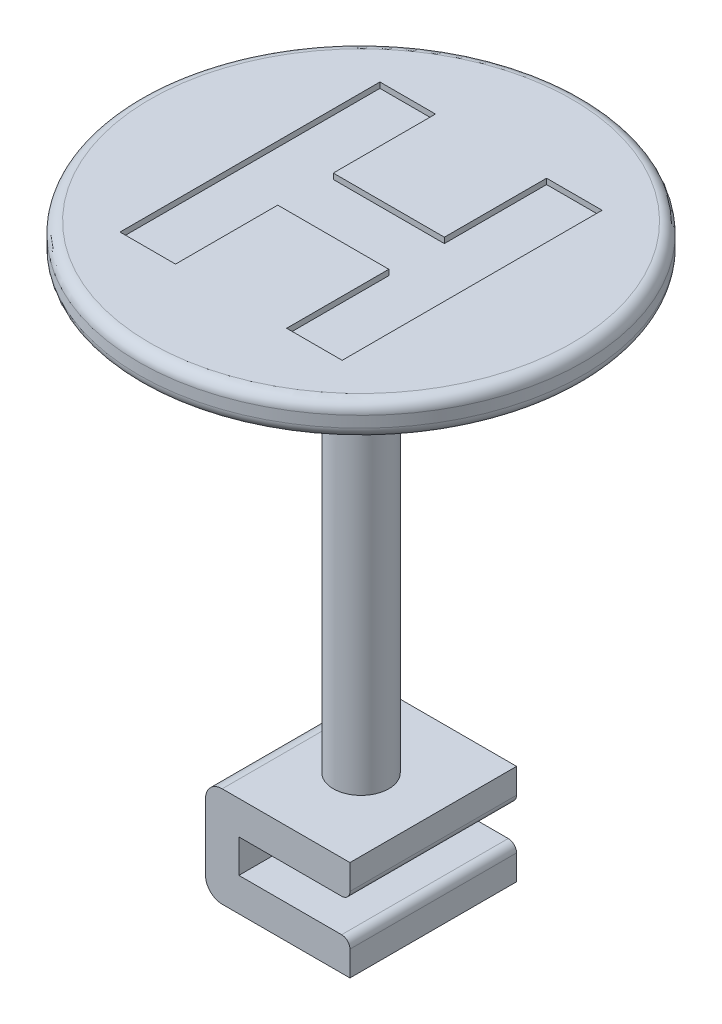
ISO-10303-21;
HEADER;
FILE_DESCRIPTION(('STEP AP214'),'2;1');
FILE_NAME('part.step','',(''),(''),'','','');
FILE_SCHEMA(('AUTOMOTIVE_DESIGN { 1 0 10303 214 1 1 1 1 }'));
ENDSEC;
DATA;
#1=APPLICATION_CONTEXT('core data for automotive mechanical design processes');
#2=APPLICATION_PROTOCOL_DEFINITION('international standard','automotive_design',2000,#1);
#3=PRODUCT_CONTEXT('',#1,'mechanical');
#4=PRODUCT('Part','Part','',(#3));
#5=PRODUCT_RELATED_PRODUCT_CATEGORY('part','',(#4));
#6=PRODUCT_DEFINITION_FORMATION('','',#4);
#7=PRODUCT_DEFINITION_CONTEXT('part definition',#1,'design');
#8=PRODUCT_DEFINITION('design','',#6,#7);
#9=PRODUCT_DEFINITION_SHAPE('','',#8);
#10=(LENGTH_UNIT() NAMED_UNIT(*) SI_UNIT(.MILLI.,.METRE.));
#11=(NAMED_UNIT(*) PLANE_ANGLE_UNIT() SI_UNIT($,.RADIAN.));
#12=(NAMED_UNIT(*) SI_UNIT($,.STERADIAN.) SOLID_ANGLE_UNIT());
#13=UNCERTAINTY_MEASURE_WITH_UNIT(LENGTH_MEASURE(1.E-05),#10,'distance_accuracy_value','');
#14=(GEOMETRIC_REPRESENTATION_CONTEXT(3) GLOBAL_UNCERTAINTY_ASSIGNED_CONTEXT((#13)) GLOBAL_UNIT_ASSIGNED_CONTEXT((#10,
#11,#12)) REPRESENTATION_CONTEXT('',''));
#15=CARTESIAN_POINT('',(0.,0.,0.));
#16=DIRECTION('',(0.,0.,1.));
#17=DIRECTION('',(1.,0.,0.));
#18=AXIS2_PLACEMENT_3D('',#15,#16,#17);
#19=CARTESIAN_POINT('',(-3.,6.,15.));
#20=DIRECTION('',(0.,-1.,0.));
#21=DIRECTION('',(0.,0.,-1.));
#22=AXIS2_PLACEMENT_3D('',#19,#20,#21);
#23=PLANE('',#22);
#24=DIRECTION('',(-1.,0.,0.));
#25=VECTOR('',#24,1.);
#26=CARTESIAN_POINT('',(-3.,6.,0.));
#27=LINE('',#26,#25);
#28=CARTESIAN_POINT('',(10.,6.,0.));
#29=VERTEX_POINT('',#28);
#30=CARTESIAN_POINT('',(-1.5,6.,0.));
#31=VERTEX_POINT('',#30);
#32=EDGE_CURVE('E317',#29,#31,#27,.T.);
#33=ORIENTED_EDGE('',*,*,#32,.T.);
#34=DIRECTION('',(0.,0.,-1.));
#35=VECTOR('',#34,1.);
#36=CARTESIAN_POINT('',(-1.5,6.,15.));
#37=LINE('',#36,#35);
#38=CARTESIAN_POINT('',(-1.5,6.,15.));
#39=VERTEX_POINT('',#38);
#40=EDGE_CURVE('E49',#31,#39,#37,.F.);
#41=ORIENTED_EDGE('',*,*,#40,.T.);
#42=DIRECTION('',(-1.,0.,0.));
#43=VECTOR('',#42,1.);
#44=CARTESIAN_POINT('',(-3.,6.,15.));
#45=LINE('',#44,#43);
#46=CARTESIAN_POINT('',(10.,6.,15.));
#47=VERTEX_POINT('',#46);
#48=EDGE_CURVE('E336',#47,#39,#45,.T.);
#49=ORIENTED_EDGE('',*,*,#48,.F.);
#50=DIRECTION('',(0.,0.,-1.));
#51=VECTOR('',#50,1.);
#52=CARTESIAN_POINT('',(10.,6.,15.));
#53=LINE('',#52,#51);
#54=EDGE_CURVE('E353',#47,#29,#53,.T.);
#55=ORIENTED_EDGE('',*,*,#54,.T.);
#56=EDGE_LOOP('',(#33,#41,#49,#55));
#57=FACE_BOUND('',#56,.T.);
#58=CARTESIAN_POINT('',(3.5,6.,7.5));
#59=DIRECTION('',(0.,-1.,0.));
#60=DIRECTION('',(0.,0.,-1.));
#61=AXIS2_PLACEMENT_3D('',#58,#59,#60);
#62=CIRCLE('',#61,2.5);
#63=CARTESIAN_POINT('',(3.5,6.,5.));
#64=VERTEX_POINT('',#63);
#65=EDGE_CURVE('E377',#64,#64,#62,.F.);
#66=ORIENTED_EDGE('',*,*,#65,.F.);
#67=EDGE_LOOP('',(#66));
#68=FACE_BOUND('',#67,.T.);
#69=ADVANCED_FACE('F34',(#57,#68),#23,.F.);
#70=CARTESIAN_POINT('',(0.,0.,15.));
#71=DIRECTION('',(-1.,0.,0.));
#72=DIRECTION('',(0.,0.,1.));
#73=AXIS2_PLACEMENT_3D('',#70,#71,#72);
#74=PLANE('',#73);
#75=DIRECTION('',(0.,1.,0.));
#76=VECTOR('',#75,1.);
#77=CARTESIAN_POINT('',(0.,0.,0.));
#78=LINE('',#77,#76);
#79=CARTESIAN_POINT('',(0.,0.,0.));
#80=VERTEX_POINT('',#79);
#81=CARTESIAN_POINT('',(0.,3.,0.));
#82=VERTEX_POINT('',#81);
#83=EDGE_CURVE('E309',#80,#82,#78,.T.);
#84=ORIENTED_EDGE('',*,*,#83,.T.);
#85=DIRECTION('',(0.,0.,-1.));
#86=VECTOR('',#85,1.);
#87=CARTESIAN_POINT('',(0.,3.,15.));
#88=LINE('',#87,#86);
#89=CARTESIAN_POINT('',(0.,3.,15.));
#90=VERTEX_POINT('',#89);
#91=EDGE_CURVE('E356',#90,#82,#88,.T.);
#92=ORIENTED_EDGE('',*,*,#91,.F.);
#93=DIRECTION('',(0.,1.,0.));
#94=VECTOR('',#93,1.);
#95=CARTESIAN_POINT('',(0.,0.,15.));
#96=LINE('',#95,#94);
#97=CARTESIAN_POINT('',(0.,0.,15.));
#98=VERTEX_POINT('',#97);
#99=EDGE_CURVE('E328',#98,#90,#96,.T.);
#100=ORIENTED_EDGE('',*,*,#99,.F.);
#101=DIRECTION('',(0.,0.,-1.));
#102=VECTOR('',#101,1.);
#103=CARTESIAN_POINT('',(0.,0.,15.));
#104=LINE('',#103,#102);
#105=EDGE_CURVE('E347',#98,#80,#104,.T.);
#106=ORIENTED_EDGE('',*,*,#105,.T.);
#107=EDGE_LOOP('',(#84,#92,#100,#106));
#108=FACE_BOUND('',#107,.T.);
#109=ADVANCED_FACE('F36',(#108),#74,.F.);
#110=CARTESIAN_POINT('',(0.,3.,15.));
#111=DIRECTION('',(0.,1.,0.));
#112=DIRECTION('',(0.,0.,1.));
#113=AXIS2_PLACEMENT_3D('',#110,#111,#112);
#114=PLANE('',#113);
#115=DIRECTION('',(1.,0.,0.));
#116=VECTOR('',#115,1.);
#117=CARTESIAN_POINT('',(0.,3.,0.));
#118=LINE('',#117,#116);
#119=CARTESIAN_POINT('',(9.25,3.,0.));
#120=VERTEX_POINT('',#119);
#121=EDGE_CURVE('E312',#82,#120,#118,.T.);
#122=ORIENTED_EDGE('',*,*,#121,.T.);
#123=DIRECTION('',(0.,0.,-1.));
#124=VECTOR('',#123,1.);
#125=CARTESIAN_POINT('',(9.25,3.,15.));
#126=LINE('',#125,#124);
#127=CARTESIAN_POINT('',(9.25,3.,15.));
#128=VERTEX_POINT('',#127);
#129=EDGE_CURVE('E375',#120,#128,#126,.F.);
#130=ORIENTED_EDGE('',*,*,#129,.T.);
#131=DIRECTION('',(1.,0.,0.));
#132=VECTOR('',#131,1.);
#133=CARTESIAN_POINT('',(0.,3.,15.));
#134=LINE('',#133,#132);
#135=EDGE_CURVE('E331',#90,#128,#134,.T.);
#136=ORIENTED_EDGE('',*,*,#135,.F.);
#137=ORIENTED_EDGE('',*,*,#91,.T.);
#138=EDGE_LOOP('',(#122,#130,#136,#137));
#139=FACE_BOUND('',#138,.T.);
#140=ADVANCED_FACE('F441',(#139),#114,.F.);
#141=CARTESIAN_POINT('',(10.,3.,15.));
#142=DIRECTION('',(-1.,0.,0.));
#143=DIRECTION('',(0.,0.,1.));
#144=AXIS2_PLACEMENT_3D('',#141,#142,#143);
#145=PLANE('',#144);
#146=DIRECTION('',(0.,1.,0.));
#147=VECTOR('',#146,1.);
#148=CARTESIAN_POINT('',(10.,3.,15.));
#149=LINE('',#148,#147);
#150=CARTESIAN_POINT('',(10.,3.75,15.));
#151=VERTEX_POINT('',#150);
#152=EDGE_CURVE('E334',#151,#47,#149,.T.);
#153=ORIENTED_EDGE('',*,*,#152,.F.);
#154=DIRECTION('',(0.,0.,-1.));
#155=VECTOR('',#154,1.);
#156=CARTESIAN_POINT('',(10.,3.75,15.));
#157=LINE('',#156,#155);
#158=CARTESIAN_POINT('',(10.,3.75,0.));
#159=VERTEX_POINT('',#158);
#160=EDGE_CURVE('E372',#151,#159,#157,.T.);
#161=ORIENTED_EDGE('',*,*,#160,.T.);
#162=DIRECTION('',(0.,1.,0.));
#163=VECTOR('',#162,1.);
#164=CARTESIAN_POINT('',(10.,3.,0.));
#165=LINE('',#164,#163);
#166=EDGE_CURVE('E315',#159,#29,#165,.T.);
#167=ORIENTED_EDGE('',*,*,#166,.T.);
#168=ORIENTED_EDGE('',*,*,#54,.F.);
#169=EDGE_LOOP('',(#153,#161,#167,#168));
#170=FACE_BOUND('',#169,.T.);
#171=ADVANCED_FACE('F448',(#170),#145,.F.);
#172=CARTESIAN_POINT('',(-3.,-3.,15.));
#173=DIRECTION('',(1.,0.,0.));
#174=DIRECTION('',(0.,1.,0.));
#175=AXIS2_PLACEMENT_3D('',#172,#173,#174);
#176=PLANE('',#175);
#177=DIRECTION('',(0.,-1.,0.));
#178=VECTOR('',#177,1.);
#179=CARTESIAN_POINT('',(-3.,-3.,0.));
#180=LINE('',#179,#178);
#181=CARTESIAN_POINT('',(-3.,4.5,0.));
#182=VERTEX_POINT('',#181);
#183=CARTESIAN_POINT('',(-3.,-1.5,0.));
#184=VERTEX_POINT('',#183);
#185=EDGE_CURVE('E319',#182,#184,#180,.T.);
#186=ORIENTED_EDGE('',*,*,#185,.T.);
#187=DIRECTION('',(0.,0.,-1.));
#188=VECTOR('',#187,1.);
#189=CARTESIAN_POINT('',(-3.,-1.5,15.));
#190=LINE('',#189,#188);
#191=CARTESIAN_POINT('',(-3.,-1.5,15.));
#192=VERTEX_POINT('',#191);
#193=EDGE_CURVE('E57',#184,#192,#190,.F.);
#194=ORIENTED_EDGE('',*,*,#193,.T.);
#195=DIRECTION('',(0.,-1.,0.));
#196=VECTOR('',#195,1.);
#197=CARTESIAN_POINT('',(-3.,-3.,15.));
#198=LINE('',#197,#196);
#199=CARTESIAN_POINT('',(-3.,4.5,15.));
#200=VERTEX_POINT('',#199);
#201=EDGE_CURVE('E338',#200,#192,#198,.T.);
#202=ORIENTED_EDGE('',*,*,#201,.F.);
#203=DIRECTION('',(0.,0.,-1.));
#204=VECTOR('',#203,1.);
#205=CARTESIAN_POINT('',(-3.,4.5,15.));
#206=LINE('',#205,#204);
#207=EDGE_CURVE('E387',#200,#182,#206,.T.);
#208=ORIENTED_EDGE('',*,*,#207,.T.);
#209=EDGE_LOOP('',(#186,#194,#202,#208));
#210=FACE_BOUND('',#209,.T.);
#211=ADVANCED_FACE('F446',(#210),#176,.F.);
#212=CARTESIAN_POINT('',(-3.,-3.,15.));
#213=DIRECTION('',(0.,1.,0.));
#214=DIRECTION('',(0.,0.,1.));
#215=AXIS2_PLACEMENT_3D('',#212,#213,#214);
#216=PLANE('',#215);
#217=DIRECTION('',(1.,0.,0.));
#218=VECTOR('',#217,1.);
#219=CARTESIAN_POINT('',(-3.,-3.,15.));
#220=LINE('',#219,#218);
#221=CARTESIAN_POINT('',(-1.5,-3.,15.));
#222=VERTEX_POINT('',#221);
#223=CARTESIAN_POINT('',(10.,-3.,15.));
#224=VERTEX_POINT('',#223);
#225=EDGE_CURVE('E340',#222,#224,#220,.T.);
#226=ORIENTED_EDGE('',*,*,#225,.F.);
#227=DIRECTION('',(0.,0.,-1.));
#228=VECTOR('',#227,1.);
#229=CARTESIAN_POINT('',(-1.5,-3.,15.));
#230=LINE('',#229,#228);
#231=CARTESIAN_POINT('',(-1.5,-3.,0.));
#232=VERTEX_POINT('',#231);
#233=EDGE_CURVE('E380',#222,#232,#230,.T.);
#234=ORIENTED_EDGE('',*,*,#233,.T.);
#235=DIRECTION('',(1.,0.,0.));
#236=VECTOR('',#235,1.);
#237=CARTESIAN_POINT('',(-3.,-3.,0.));
#238=LINE('',#237,#236);
#239=CARTESIAN_POINT('',(10.,-3.,0.));
#240=VERTEX_POINT('',#239);
#241=EDGE_CURVE('E321',#232,#240,#238,.T.);
#242=ORIENTED_EDGE('',*,*,#241,.T.);
#243=DIRECTION('',(0.,0.,-1.));
#244=VECTOR('',#243,1.);
#245=CARTESIAN_POINT('',(10.,-3.,15.));
#246=LINE('',#245,#244);
#247=EDGE_CURVE('E350',#224,#240,#246,.T.);
#248=ORIENTED_EDGE('',*,*,#247,.F.);
#249=EDGE_LOOP('',(#226,#234,#242,#248));
#250=FACE_BOUND('',#249,.T.);
#251=ADVANCED_FACE('F482',(#250),#216,.F.);
#252=CARTESIAN_POINT('',(10.,0.,15.));
#253=DIRECTION('',(-1.,0.,0.));
#254=DIRECTION('',(0.,0.,1.));
#255=AXIS2_PLACEMENT_3D('',#252,#253,#254);
#256=PLANE('',#255);
#257=DIRECTION('',(0.,1.,0.));
#258=VECTOR('',#257,1.);
#259=CARTESIAN_POINT('',(10.,0.,0.));
#260=LINE('',#259,#258);
#261=CARTESIAN_POINT('',(10.,-0.75,0.));
#262=VERTEX_POINT('',#261);
#263=EDGE_CURVE('E323',#240,#262,#260,.T.);
#264=ORIENTED_EDGE('',*,*,#263,.T.);
#265=DIRECTION('',(0.,0.,-1.));
#266=VECTOR('',#265,1.);
#267=CARTESIAN_POINT('',(10.,-0.75,15.));
#268=LINE('',#267,#266);
#269=CARTESIAN_POINT('',(10.,-0.75,15.));
#270=VERTEX_POINT('',#269);
#271=EDGE_CURVE('E366',#262,#270,#268,.F.);
#272=ORIENTED_EDGE('',*,*,#271,.T.);
#273=DIRECTION('',(0.,1.,0.));
#274=VECTOR('',#273,1.);
#275=CARTESIAN_POINT('',(10.,0.,15.));
#276=LINE('',#275,#274);
#277=EDGE_CURVE('E342',#224,#270,#276,.T.);
#278=ORIENTED_EDGE('',*,*,#277,.F.);
#279=ORIENTED_EDGE('',*,*,#247,.T.);
#280=EDGE_LOOP('',(#264,#272,#278,#279));
#281=FACE_BOUND('',#280,.T.);
#282=ADVANCED_FACE('F497',(#281),#256,.F.);
#283=CARTESIAN_POINT('',(0.,0.,15.));
#284=DIRECTION('',(0.,-1.,0.));
#285=DIRECTION('',(0.,0.,-1.));
#286=AXIS2_PLACEMENT_3D('',#283,#284,#285);
#287=PLANE('',#286);
#288=DIRECTION('',(-1.,0.,0.));
#289=VECTOR('',#288,1.);
#290=CARTESIAN_POINT('',(0.,0.,15.));
#291=LINE('',#290,#289);
#292=CARTESIAN_POINT('',(9.25,0.,15.));
#293=VERTEX_POINT('',#292);
#294=EDGE_CURVE('E345',#293,#98,#291,.T.);
#295=ORIENTED_EDGE('',*,*,#294,.F.);
#296=DIRECTION('',(0.,0.,-1.));
#297=VECTOR('',#296,1.);
#298=CARTESIAN_POINT('',(9.25,0.,15.));
#299=LINE('',#298,#297);
#300=CARTESIAN_POINT('',(9.25,0.,0.));
#301=VERTEX_POINT('',#300);
#302=EDGE_CURVE('E359',#293,#301,#299,.T.);
#303=ORIENTED_EDGE('',*,*,#302,.T.);
#304=DIRECTION('',(-1.,0.,0.));
#305=VECTOR('',#304,1.);
#306=CARTESIAN_POINT('',(0.,0.,0.));
#307=LINE('',#306,#305);
#308=EDGE_CURVE('E326',#301,#80,#307,.T.);
#309=ORIENTED_EDGE('',*,*,#308,.T.);
#310=ORIENTED_EDGE('',*,*,#105,.F.);
#311=EDGE_LOOP('',(#295,#303,#309,#310));
#312=FACE_BOUND('',#311,.T.);
#313=ADVANCED_FACE('F494',(#312),#287,.F.);
#314=CARTESIAN_POINT('',(0.,3.,15.));
#315=DIRECTION('',(0.,0.,-1.));
#316=DIRECTION('',(-1.,0.,0.));
#317=AXIS2_PLACEMENT_3D('',#314,#315,#316);
#318=PLANE('',#317);
#319=ORIENTED_EDGE('',*,*,#201,.T.);
#320=CARTESIAN_POINT('',(-1.5,-1.5,15.));
#321=DIRECTION('',(0.,0.,-1.));
#322=DIRECTION('',(-1.,0.,0.));
#323=AXIS2_PLACEMENT_3D('',#320,#321,#322);
#324=CIRCLE('',#323,1.5);
#325=EDGE_CURVE('E393',#192,#222,#324,.F.);
#326=ORIENTED_EDGE('',*,*,#325,.T.);
#327=ORIENTED_EDGE('',*,*,#225,.T.);
#328=ORIENTED_EDGE('',*,*,#277,.T.);
#329=CARTESIAN_POINT('',(9.25,-0.75,15.));
#330=DIRECTION('',(0.,0.,-1.));
#331=DIRECTION('',(-1.,0.,0.));
#332=AXIS2_PLACEMENT_3D('',#329,#330,#331);
#333=CIRCLE('',#332,0.75);
#334=EDGE_CURVE('E370',#270,#293,#333,.F.);
#335=ORIENTED_EDGE('',*,*,#334,.T.);
#336=ORIENTED_EDGE('',*,*,#294,.T.);
#337=ORIENTED_EDGE('',*,*,#99,.T.);
#338=ORIENTED_EDGE('',*,*,#135,.T.);
#339=CARTESIAN_POINT('',(9.25,3.75,15.));
#340=DIRECTION('',(0.,0.,-1.));
#341=DIRECTION('',(-1.,0.,0.));
#342=AXIS2_PLACEMENT_3D('',#339,#340,#341);
#343=CIRCLE('',#342,0.75);
#344=EDGE_CURVE('E368',#128,#151,#343,.F.);
#345=ORIENTED_EDGE('',*,*,#344,.T.);
#346=ORIENTED_EDGE('',*,*,#152,.T.);
#347=ORIENTED_EDGE('',*,*,#48,.T.);
#348=CARTESIAN_POINT('',(-1.5,4.5,15.));
#349=DIRECTION('',(0.,0.,-1.));
#350=DIRECTION('',(-1.,0.,0.));
#351=AXIS2_PLACEMENT_3D('',#348,#349,#350);
#352=CIRCLE('',#351,1.5);
#353=EDGE_CURVE('E391',#39,#200,#352,.F.);
#354=ORIENTED_EDGE('',*,*,#353,.T.);
#355=EDGE_LOOP('',(#319,#326,#327,#328,#335,#336,#337,#338,#345,#346,#347,#354));
#356=FACE_BOUND('',#355,.T.);
#357=ADVANCED_FACE('F465',(#356),#318,.F.);
#358=CARTESIAN_POINT('',(0.,3.,0.));
#359=DIRECTION('',(0.,0.,-1.));
#360=DIRECTION('',(-1.,0.,0.));
#361=AXIS2_PLACEMENT_3D('',#358,#359,#360);
#362=PLANE('',#361);
#363=ORIENTED_EDGE('',*,*,#241,.F.);
#364=CARTESIAN_POINT('',(-1.5,-1.5,0.));
#365=DIRECTION('',(0.,0.,-1.));
#366=DIRECTION('',(-1.,0.,0.));
#367=AXIS2_PLACEMENT_3D('',#364,#365,#366);
#368=CIRCLE('',#367,1.5);
#369=EDGE_CURVE('E385',#232,#184,#368,.T.);
#370=ORIENTED_EDGE('',*,*,#369,.T.);
#371=ORIENTED_EDGE('',*,*,#185,.F.);
#372=CARTESIAN_POINT('',(-1.5,4.5,0.));
#373=DIRECTION('',(0.,0.,-1.));
#374=DIRECTION('',(-1.,0.,0.));
#375=AXIS2_PLACEMENT_3D('',#372,#373,#374);
#376=CIRCLE('',#375,1.5);
#377=EDGE_CURVE('E383',#182,#31,#376,.T.);
#378=ORIENTED_EDGE('',*,*,#377,.T.);
#379=ORIENTED_EDGE('',*,*,#32,.F.);
#380=ORIENTED_EDGE('',*,*,#166,.F.);
#381=CARTESIAN_POINT('',(9.25,3.75,0.));
#382=DIRECTION('',(0.,0.,-1.));
#383=DIRECTION('',(-1.,0.,0.));
#384=AXIS2_PLACEMENT_3D('',#381,#382,#383);
#385=CIRCLE('',#384,0.75);
#386=EDGE_CURVE('E362',#159,#120,#385,.T.);
#387=ORIENTED_EDGE('',*,*,#386,.T.);
#388=ORIENTED_EDGE('',*,*,#121,.F.);
#389=ORIENTED_EDGE('',*,*,#83,.F.);
#390=ORIENTED_EDGE('',*,*,#308,.F.);
#391=CARTESIAN_POINT('',(9.25,-0.75,0.));
#392=DIRECTION('',(0.,0.,-1.));
#393=DIRECTION('',(-1.,0.,0.));
#394=AXIS2_PLACEMENT_3D('',#391,#392,#393);
#395=CIRCLE('',#394,0.75);
#396=EDGE_CURVE('E364',#301,#262,#395,.T.);
#397=ORIENTED_EDGE('',*,*,#396,.T.);
#398=ORIENTED_EDGE('',*,*,#263,.F.);
#399=EDGE_LOOP('',(#363,#370,#371,#378,#379,#380,#387,#388,#389,#390,#397,#398));
#400=FACE_BOUND('',#399,.T.);
#401=ADVANCED_FACE('F474',(#400),#362,.T.);
#402=CARTESIAN_POINT('',(9.25,-0.75,15.));
#403=DIRECTION('',(0.,0.,-1.));
#404=DIRECTION('',(-1.,0.,0.));
#405=AXIS2_PLACEMENT_3D('',#402,#403,#404);
#406=CYLINDRICAL_SURFACE('',#405,0.75);
#407=ORIENTED_EDGE('',*,*,#334,.F.);
#408=ORIENTED_EDGE('',*,*,#271,.F.);
#409=ORIENTED_EDGE('',*,*,#396,.F.);
#410=ORIENTED_EDGE('',*,*,#302,.F.);
#411=EDGE_LOOP('',(#407,#408,#409,#410));
#412=FACE_BOUND('',#411,.T.);
#413=ADVANCED_FACE('F491',(#412),#406,.T.);
#414=CARTESIAN_POINT('',(9.25,3.75,15.));
#415=DIRECTION('',(0.,0.,-1.));
#416=DIRECTION('',(-1.,0.,0.));
#417=AXIS2_PLACEMENT_3D('',#414,#415,#416);
#418=CYLINDRICAL_SURFACE('',#417,0.75);
#419=ORIENTED_EDGE('',*,*,#344,.F.);
#420=ORIENTED_EDGE('',*,*,#129,.F.);
#421=ORIENTED_EDGE('',*,*,#386,.F.);
#422=ORIENTED_EDGE('',*,*,#160,.F.);
#423=EDGE_LOOP('',(#419,#420,#421,#422));
#424=FACE_BOUND('',#423,.T.);
#425=ADVANCED_FACE('F461',(#424),#418,.T.);
#426=CARTESIAN_POINT('',(3.5,46.,7.5));
#427=DIRECTION('',(0.,-1.,0.));
#428=DIRECTION('',(0.,0.,-1.));
#429=AXIS2_PLACEMENT_3D('',#426,#427,#428);
#430=CYLINDRICAL_SURFACE('',#429,2.5);
#431=CARTESIAN_POINT('',(3.5,46.,7.5));
#432=DIRECTION('',(0.,1.,0.));
#433=DIRECTION('',(0.,0.,1.));
#434=AXIS2_PLACEMENT_3D('',#431,#432,#433);
#435=CIRCLE('',#434,2.5);
#436=CARTESIAN_POINT('',(3.5,46.,10.));
#437=VERTEX_POINT('',#436);
#438=EDGE_CURVE('E288',#437,#437,#435,.T.);
#439=ORIENTED_EDGE('',*,*,#438,.F.);
#440=EDGE_LOOP('',(#439));
#441=FACE_BOUND('',#440,.T.);
#442=ORIENTED_EDGE('',*,*,#65,.T.);
#443=EDGE_LOOP('',(#442));
#444=FACE_BOUND('',#443,.T.);
#445=ADVANCED_FACE('F514',(#441,#444),#430,.T.);
#446=CARTESIAN_POINT('',(3.5,46.,7.5));
#447=DIRECTION('',(0.,1.,0.));
#448=DIRECTION('',(0.,0.,1.));
#449=AXIS2_PLACEMENT_3D('',#446,#447,#448);
#450=PLANE('',#449);
#451=CARTESIAN_POINT('',(3.5,46.,7.5));
#452=DIRECTION('',(0.,1.,0.));
#453=DIRECTION('',(0.,0.,1.));
#454=AXIS2_PLACEMENT_3D('',#451,#452,#453);
#455=CIRCLE('',#454,19.);
#456=CARTESIAN_POINT('',(3.5,46.,26.5));
#457=VERTEX_POINT('',#456);
#458=EDGE_CURVE('E42',#457,#457,#455,.F.);
#459=ORIENTED_EDGE('',*,*,#458,.T.);
#460=EDGE_LOOP('',(#459));
#461=FACE_BOUND('',#460,.T.);
#462=ORIENTED_EDGE('',*,*,#438,.T.);
#463=EDGE_LOOP('',(#462));
#464=FACE_BOUND('',#463,.T.);
#465=ADVANCED_FACE('F404',(#461,#464),#450,.F.);
#466=CARTESIAN_POINT('',(3.5,49.,7.5));
#467=DIRECTION('',(0.,-1.,0.));
#468=DIRECTION('',(0.,0.,-1.));
#469=AXIS2_PLACEMENT_3D('',#466,#467,#468);
#470=CYLINDRICAL_SURFACE('',#469,20.);
#471=CARTESIAN_POINT('',(3.5,47.,7.5));
#472=DIRECTION('',(0.,1.,0.));
#473=DIRECTION('',(0.,0.,1.));
#474=AXIS2_PLACEMENT_3D('',#471,#472,#473);
#475=CIRCLE('',#474,20.);
#476=CARTESIAN_POINT('',(3.5,47.,27.5));
#477=VERTEX_POINT('',#476);
#478=EDGE_CURVE('E399',#477,#477,#475,.T.);
#479=ORIENTED_EDGE('',*,*,#478,.T.);
#480=EDGE_LOOP('',(#479));
#481=FACE_BOUND('',#480,.T.);
#482=CARTESIAN_POINT('',(3.5,48.,7.5));
#483=DIRECTION('',(0.,1.,0.));
#484=DIRECTION('',(0.,0.,1.));
#485=AXIS2_PLACEMENT_3D('',#482,#483,#484);
#486=CIRCLE('',#485,20.);
#487=CARTESIAN_POINT('',(3.5,48.,27.5));
#488=VERTEX_POINT('',#487);
#489=EDGE_CURVE('E396',#488,#488,#486,.F.);
#490=ORIENTED_EDGE('',*,*,#489,.T.);
#491=EDGE_LOOP('',(#490));
#492=FACE_BOUND('',#491,.T.);
#493=ADVANCED_FACE('F415',(#481,#492),#470,.T.);
#494=CARTESIAN_POINT('',(3.5,49.,7.5));
#495=DIRECTION('',(0.,1.,0.));
#496=DIRECTION('',(0.,0.,1.));
#497=AXIS2_PLACEMENT_3D('',#494,#495,#496);
#498=PLANE('',#497);
#499=CARTESIAN_POINT('',(3.5,49.,7.5));
#500=DIRECTION('',(0.,1.,0.));
#501=DIRECTION('',(0.,0.,1.));
#502=AXIS2_PLACEMENT_3D('',#499,#500,#501);
#503=CIRCLE('',#502,19.);
#504=CARTESIAN_POINT('',(3.5,49.,26.5));
#505=VERTEX_POINT('',#504);
#506=EDGE_CURVE('E11',#505,#505,#503,.T.);
#507=ORIENTED_EDGE('',*,*,#506,.T.);
#508=EDGE_LOOP('',(#507));
#509=FACE_BOUND('',#508,.T.);
#510=DIRECTION('',(0.,0.,1.));
#511=VECTOR('',#510,1.);
#512=CARTESIAN_POINT('',(8.5,49.,-4.19890178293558));
#513=LINE('',#512,#511);
#514=CARTESIAN_POINT('',(8.5,49.,-4.19890178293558));
#515=VERTEX_POINT('',#514);
#516=CARTESIAN_POINT('',(8.5,49.,5.));
#517=VERTEX_POINT('',#516);
#518=EDGE_CURVE('E219',#515,#517,#513,.T.);
#519=ORIENTED_EDGE('',*,*,#518,.F.);
#520=DIRECTION('',(-1.,0.,0.));
#521=VECTOR('',#520,1.);
#522=CARTESIAN_POINT('',(8.5,49.,-4.19890178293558));
#523=LINE('',#522,#521);
#524=CARTESIAN_POINT('',(13.5,49.,-4.19890178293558));
#525=VERTEX_POINT('',#524);
#526=EDGE_CURVE('E250',#525,#515,#523,.T.);
#527=ORIENTED_EDGE('',*,*,#526,.F.);
#528=DIRECTION('',(0.,0.,-1.));
#529=VECTOR('',#528,1.);
#530=CARTESIAN_POINT('',(13.5,49.,-4.19890178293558));
#531=LINE('',#530,#529);
#532=CARTESIAN_POINT('',(13.5,49.,19.1989017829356));
#533=VERTEX_POINT('',#532);
#534=EDGE_CURVE('E247',#533,#525,#531,.T.);
#535=ORIENTED_EDGE('',*,*,#534,.F.);
#536=DIRECTION('',(1.,0.,0.));
#537=VECTOR('',#536,1.);
#538=CARTESIAN_POINT('',(8.5,49.,19.1989017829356));
#539=LINE('',#538,#537);
#540=CARTESIAN_POINT('',(8.5,49.,19.1989017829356));
#541=VERTEX_POINT('',#540);
#542=EDGE_CURVE('E244',#541,#533,#539,.T.);
#543=ORIENTED_EDGE('',*,*,#542,.F.);
#544=DIRECTION('',(0.,0.,1.));
#545=VECTOR('',#544,1.);
#546=CARTESIAN_POINT('',(8.5,49.,19.1989017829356));
#547=LINE('',#546,#545);
#548=CARTESIAN_POINT('',(8.5,49.,10.));
#549=VERTEX_POINT('',#548);
#550=EDGE_CURVE('E241',#549,#541,#547,.T.);
#551=ORIENTED_EDGE('',*,*,#550,.F.);
#552=DIRECTION('',(1.,0.,0.));
#553=VECTOR('',#552,1.);
#554=CARTESIAN_POINT('',(8.5,49.,10.));
#555=LINE('',#554,#553);
#556=CARTESIAN_POINT('',(-1.5,49.,10.));
#557=VERTEX_POINT('',#556);
#558=EDGE_CURVE('E238',#557,#549,#555,.T.);
#559=ORIENTED_EDGE('',*,*,#558,.F.);
#560=DIRECTION('',(0.,0.,-1.));
#561=VECTOR('',#560,1.);
#562=CARTESIAN_POINT('',(-1.5,49.,19.1989017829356));
#563=LINE('',#562,#561);
#564=CARTESIAN_POINT('',(-1.5,49.,19.1989017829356));
#565=VERTEX_POINT('',#564);
#566=EDGE_CURVE('E235',#565,#557,#563,.T.);
#567=ORIENTED_EDGE('',*,*,#566,.F.);
#568=DIRECTION('',(1.,0.,0.));
#569=VECTOR('',#568,1.);
#570=CARTESIAN_POINT('',(-1.5,49.,19.1989017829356));
#571=LINE('',#570,#569);
#572=CARTESIAN_POINT('',(-6.5,49.,19.1989017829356));
#573=VERTEX_POINT('',#572);
#574=EDGE_CURVE('E232',#573,#565,#571,.T.);
#575=ORIENTED_EDGE('',*,*,#574,.F.);
#576=DIRECTION('',(0.,0.,1.));
#577=VECTOR('',#576,1.);
#578=CARTESIAN_POINT('',(-6.5,49.,19.1989017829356));
#579=LINE('',#578,#577);
#580=CARTESIAN_POINT('',(-6.5,49.,-4.19890178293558));
#581=VERTEX_POINT('',#580);
#582=EDGE_CURVE('E226',#581,#573,#579,.T.);
#583=ORIENTED_EDGE('',*,*,#582,.F.);
#584=DIRECTION('',(-1.,0.,0.));
#585=VECTOR('',#584,1.);
#586=CARTESIAN_POINT('',(-1.5,49.,-4.19890178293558));
#587=LINE('',#586,#585);
#588=CARTESIAN_POINT('',(-1.5,49.,-4.19890178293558));
#589=VERTEX_POINT('',#588);
#590=EDGE_CURVE('E224',#589,#581,#587,.T.);
#591=ORIENTED_EDGE('',*,*,#590,.F.);
#592=DIRECTION('',(0.,0.,-1.));
#593=VECTOR('',#592,1.);
#594=CARTESIAN_POINT('',(-1.5,49.,-4.19890178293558));
#595=LINE('',#594,#593);
#596=CARTESIAN_POINT('',(-1.5,49.,5.));
#597=VERTEX_POINT('',#596);
#598=EDGE_CURVE('E203',#597,#589,#595,.T.);
#599=ORIENTED_EDGE('',*,*,#598,.F.);
#600=DIRECTION('',(-1.,0.,0.));
#601=VECTOR('',#600,1.);
#602=CARTESIAN_POINT('',(-1.5,49.,5.));
#603=LINE('',#602,#601);
#604=EDGE_CURVE('E215',#517,#597,#603,.T.);
#605=ORIENTED_EDGE('',*,*,#604,.F.);
#606=EDGE_LOOP('',(#519,#527,#535,#543,#551,#559,#567,#575,#583,#591,#599,#605));
#607=FACE_BOUND('',#606,.T.);
#608=ADVANCED_FACE('F221',(#509,#607),#498,.T.);
#609=CARTESIAN_POINT('',(8.5,48.5,-4.19890178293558));
#610=DIRECTION('',(-1.,0.,0.));
#611=DIRECTION('',(0.,0.,1.));
#612=AXIS2_PLACEMENT_3D('',#609,#610,#611);
#613=PLANE('',#612);
#614=ORIENTED_EDGE('',*,*,#518,.T.);
#615=DIRECTION('',(0.,1.,0.));
#616=VECTOR('',#615,1.);
#617=CARTESIAN_POINT('',(8.5,48.5,5.));
#618=LINE('',#617,#616);
#619=CARTESIAN_POINT('',(8.5,48.5,5.));
#620=VERTEX_POINT('',#619);
#621=EDGE_CURVE('E211',#620,#517,#618,.T.);
#622=ORIENTED_EDGE('',*,*,#621,.F.);
#623=DIRECTION('',(0.,0.,1.));
#624=VECTOR('',#623,1.);
#625=CARTESIAN_POINT('',(8.5,48.5,-4.19890178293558));
#626=LINE('',#625,#624);
#627=CARTESIAN_POINT('',(8.5,48.5,-4.19890178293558));
#628=VERTEX_POINT('',#627);
#629=EDGE_CURVE('E253',#628,#620,#626,.T.);
#630=ORIENTED_EDGE('',*,*,#629,.F.);
#631=DIRECTION('',(0.,1.,0.));
#632=VECTOR('',#631,1.);
#633=CARTESIAN_POINT('',(8.5,48.5,-4.19890178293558));
#634=LINE('',#633,#632);
#635=EDGE_CURVE('E286',#628,#515,#634,.T.);
#636=ORIENTED_EDGE('',*,*,#635,.T.);
#637=EDGE_LOOP('',(#614,#622,#630,#636));
#638=FACE_BOUND('',#637,.T.);
#639=ADVANCED_FACE('F427',(#638),#613,.F.);
#640=CARTESIAN_POINT('',(8.5,48.5,-4.19890178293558));
#641=DIRECTION('',(0.,0.,-1.));
#642=DIRECTION('',(-1.,0.,0.));
#643=AXIS2_PLACEMENT_3D('',#640,#641,#642);
#644=PLANE('',#643);
#645=ORIENTED_EDGE('',*,*,#526,.T.);
#646=ORIENTED_EDGE('',*,*,#635,.F.);
#647=DIRECTION('',(-1.,0.,0.));
#648=VECTOR('',#647,1.);
#649=CARTESIAN_POINT('',(8.5,48.5,-4.19890178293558));
#650=LINE('',#649,#648);
#651=CARTESIAN_POINT('',(13.5,48.5,-4.19890178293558));
#652=VERTEX_POINT('',#651);
#653=EDGE_CURVE('E283',#652,#628,#650,.T.);
#654=ORIENTED_EDGE('',*,*,#653,.F.);
#655=DIRECTION('',(0.,1.,0.));
#656=VECTOR('',#655,1.);
#657=CARTESIAN_POINT('',(13.5,48.5,-4.19890178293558));
#658=LINE('',#657,#656);
#659=EDGE_CURVE('E289',#652,#525,#658,.T.);
#660=ORIENTED_EDGE('',*,*,#659,.T.);
#661=EDGE_LOOP('',(#645,#646,#654,#660));
#662=FACE_BOUND('',#661,.T.);
#663=ADVANCED_FACE('F432',(#662),#644,.F.);
#664=CARTESIAN_POINT('',(13.5,48.5,-4.19890178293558));
#665=DIRECTION('',(1.,0.,0.));
#666=DIRECTION('',(0.,0.,-1.));
#667=AXIS2_PLACEMENT_3D('',#664,#665,#666);
#668=PLANE('',#667);
#669=ORIENTED_EDGE('',*,*,#534,.T.);
#670=ORIENTED_EDGE('',*,*,#659,.F.);
#671=DIRECTION('',(0.,0.,-1.));
#672=VECTOR('',#671,1.);
#673=CARTESIAN_POINT('',(13.5,48.5,-4.19890178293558));
#674=LINE('',#673,#672);
#675=CARTESIAN_POINT('',(13.5,48.5,19.1989017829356));
#676=VERTEX_POINT('',#675);
#677=EDGE_CURVE('E280',#676,#652,#674,.T.);
#678=ORIENTED_EDGE('',*,*,#677,.F.);
#679=DIRECTION('',(0.,1.,0.));
#680=VECTOR('',#679,1.);
#681=CARTESIAN_POINT('',(13.5,48.5,19.1989017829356));
#682=LINE('',#681,#680);
#683=EDGE_CURVE('E291',#676,#533,#682,.T.);
#684=ORIENTED_EDGE('',*,*,#683,.T.);
#685=EDGE_LOOP('',(#669,#670,#678,#684));
#686=FACE_BOUND('',#685,.T.);
#687=ADVANCED_FACE('F558',(#686),#668,.F.);
#688=CARTESIAN_POINT('',(8.5,48.5,19.1989017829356));
#689=DIRECTION('',(0.,0.,1.));
#690=DIRECTION('',(1.,0.,0.));
#691=AXIS2_PLACEMENT_3D('',#688,#689,#690);
#692=PLANE('',#691);
#693=ORIENTED_EDGE('',*,*,#542,.T.);
#694=ORIENTED_EDGE('',*,*,#683,.F.);
#695=DIRECTION('',(1.,0.,0.));
#696=VECTOR('',#695,1.);
#697=CARTESIAN_POINT('',(8.5,48.5,19.1989017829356));
#698=LINE('',#697,#696);
#699=CARTESIAN_POINT('',(8.5,48.5,19.1989017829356));
#700=VERTEX_POINT('',#699);
#701=EDGE_CURVE('E277',#700,#676,#698,.T.);
#702=ORIENTED_EDGE('',*,*,#701,.F.);
#703=DIRECTION('',(0.,1.,0.));
#704=VECTOR('',#703,1.);
#705=CARTESIAN_POINT('',(8.5,48.5,19.1989017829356));
#706=LINE('',#705,#704);
#707=EDGE_CURVE('E293',#700,#541,#706,.T.);
#708=ORIENTED_EDGE('',*,*,#707,.T.);
#709=EDGE_LOOP('',(#693,#694,#702,#708));
#710=FACE_BOUND('',#709,.T.);
#711=ADVANCED_FACE('F554',(#710),#692,.F.);
#712=CARTESIAN_POINT('',(8.5,48.5,19.1989017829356));
#713=DIRECTION('',(-1.,0.,0.));
#714=DIRECTION('',(0.,0.,1.));
#715=AXIS2_PLACEMENT_3D('',#712,#713,#714);
#716=PLANE('',#715);
#717=ORIENTED_EDGE('',*,*,#550,.T.);
#718=ORIENTED_EDGE('',*,*,#707,.F.);
#719=DIRECTION('',(0.,0.,1.));
#720=VECTOR('',#719,1.);
#721=CARTESIAN_POINT('',(8.5,48.5,19.1989017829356));
#722=LINE('',#721,#720);
#723=CARTESIAN_POINT('',(8.5,48.5,10.));
#724=VERTEX_POINT('',#723);
#725=EDGE_CURVE('E274',#724,#700,#722,.T.);
#726=ORIENTED_EDGE('',*,*,#725,.F.);
#727=DIRECTION('',(0.,1.,0.));
#728=VECTOR('',#727,1.);
#729=CARTESIAN_POINT('',(8.5,48.5,10.));
#730=LINE('',#729,#728);
#731=EDGE_CURVE('E295',#724,#549,#730,.T.);
#732=ORIENTED_EDGE('',*,*,#731,.T.);
#733=EDGE_LOOP('',(#717,#718,#726,#732));
#734=FACE_BOUND('',#733,.T.);
#735=ADVANCED_FACE('F550',(#734),#716,.F.);
#736=CARTESIAN_POINT('',(8.5,48.5,10.));
#737=DIRECTION('',(0.,0.,1.));
#738=DIRECTION('',(1.,0.,0.));
#739=AXIS2_PLACEMENT_3D('',#736,#737,#738);
#740=PLANE('',#739);
#741=ORIENTED_EDGE('',*,*,#558,.T.);
#742=ORIENTED_EDGE('',*,*,#731,.F.);
#743=DIRECTION('',(1.,0.,0.));
#744=VECTOR('',#743,1.);
#745=CARTESIAN_POINT('',(8.5,48.5,10.));
#746=LINE('',#745,#744);
#747=CARTESIAN_POINT('',(-1.5,48.5,10.));
#748=VERTEX_POINT('',#747);
#749=EDGE_CURVE('E271',#748,#724,#746,.T.);
#750=ORIENTED_EDGE('',*,*,#749,.F.);
#751=DIRECTION('',(0.,1.,0.));
#752=VECTOR('',#751,1.);
#753=CARTESIAN_POINT('',(-1.5,48.5,10.));
#754=LINE('',#753,#752);
#755=EDGE_CURVE('E297',#748,#557,#754,.T.);
#756=ORIENTED_EDGE('',*,*,#755,.T.);
#757=EDGE_LOOP('',(#741,#742,#750,#756));
#758=FACE_BOUND('',#757,.T.);
#759=ADVANCED_FACE('F546',(#758),#740,.F.);
#760=CARTESIAN_POINT('',(-1.5,48.5,19.1989017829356));
#761=DIRECTION('',(1.,0.,0.));
#762=DIRECTION('',(0.,0.,-1.));
#763=AXIS2_PLACEMENT_3D('',#760,#761,#762);
#764=PLANE('',#763);
#765=ORIENTED_EDGE('',*,*,#566,.T.);
#766=ORIENTED_EDGE('',*,*,#755,.F.);
#767=DIRECTION('',(0.,0.,-1.));
#768=VECTOR('',#767,1.);
#769=CARTESIAN_POINT('',(-1.5,48.5,19.1989017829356));
#770=LINE('',#769,#768);
#771=CARTESIAN_POINT('',(-1.5,48.5,19.1989017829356));
#772=VERTEX_POINT('',#771);
#773=EDGE_CURVE('E268',#772,#748,#770,.T.);
#774=ORIENTED_EDGE('',*,*,#773,.F.);
#775=DIRECTION('',(0.,1.,0.));
#776=VECTOR('',#775,1.);
#777=CARTESIAN_POINT('',(-1.5,48.5,19.1989017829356));
#778=LINE('',#777,#776);
#779=EDGE_CURVE('E299',#772,#565,#778,.T.);
#780=ORIENTED_EDGE('',*,*,#779,.T.);
#781=EDGE_LOOP('',(#765,#766,#774,#780));
#782=FACE_BOUND('',#781,.T.);
#783=ADVANCED_FACE('F542',(#782),#764,.F.);
#784=CARTESIAN_POINT('',(-1.5,48.5,19.1989017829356));
#785=DIRECTION('',(0.,0.,1.));
#786=DIRECTION('',(1.,0.,0.));
#787=AXIS2_PLACEMENT_3D('',#784,#785,#786);
#788=PLANE('',#787);
#789=ORIENTED_EDGE('',*,*,#574,.T.);
#790=ORIENTED_EDGE('',*,*,#779,.F.);
#791=DIRECTION('',(1.,0.,0.));
#792=VECTOR('',#791,1.);
#793=CARTESIAN_POINT('',(-1.5,48.5,19.1989017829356));
#794=LINE('',#793,#792);
#795=CARTESIAN_POINT('',(-6.5,48.5,19.1989017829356));
#796=VERTEX_POINT('',#795);
#797=EDGE_CURVE('E265',#796,#772,#794,.T.);
#798=ORIENTED_EDGE('',*,*,#797,.F.);
#799=DIRECTION('',(0.,1.,0.));
#800=VECTOR('',#799,1.);
#801=CARTESIAN_POINT('',(-6.5,48.5,19.1989017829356));
#802=LINE('',#801,#800);
#803=EDGE_CURVE('E301',#796,#573,#802,.T.);
#804=ORIENTED_EDGE('',*,*,#803,.T.);
#805=EDGE_LOOP('',(#789,#790,#798,#804));
#806=FACE_BOUND('',#805,.T.);
#807=ADVANCED_FACE('F538',(#806),#788,.F.);
#808=CARTESIAN_POINT('',(-6.5,48.5,19.1989017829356));
#809=DIRECTION('',(-1.,0.,0.));
#810=DIRECTION('',(0.,0.,1.));
#811=AXIS2_PLACEMENT_3D('',#808,#809,#810);
#812=PLANE('',#811);
#813=ORIENTED_EDGE('',*,*,#582,.T.);
#814=ORIENTED_EDGE('',*,*,#803,.F.);
#815=DIRECTION('',(0.,0.,1.));
#816=VECTOR('',#815,1.);
#817=CARTESIAN_POINT('',(-6.5,48.5,19.1989017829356));
#818=LINE('',#817,#816);
#819=CARTESIAN_POINT('',(-6.5,48.5,-4.19890178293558));
#820=VERTEX_POINT('',#819);
#821=EDGE_CURVE('E262',#820,#796,#818,.T.);
#822=ORIENTED_EDGE('',*,*,#821,.F.);
#823=DIRECTION('',(0.,1.,0.));
#824=VECTOR('',#823,1.);
#825=CARTESIAN_POINT('',(-6.5,48.5,-4.19890178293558));
#826=LINE('',#825,#824);
#827=EDGE_CURVE('E303',#820,#581,#826,.T.);
#828=ORIENTED_EDGE('',*,*,#827,.T.);
#829=EDGE_LOOP('',(#813,#814,#822,#828));
#830=FACE_BOUND('',#829,.T.);
#831=ADVANCED_FACE('F534',(#830),#812,.F.);
#832=CARTESIAN_POINT('',(-1.5,48.5,-4.19890178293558));
#833=DIRECTION('',(0.,0.,-1.));
#834=DIRECTION('',(-1.,0.,0.));
#835=AXIS2_PLACEMENT_3D('',#832,#833,#834);
#836=PLANE('',#835);
#837=ORIENTED_EDGE('',*,*,#590,.T.);
#838=ORIENTED_EDGE('',*,*,#827,.F.);
#839=DIRECTION('',(-1.,0.,0.));
#840=VECTOR('',#839,1.);
#841=CARTESIAN_POINT('',(-1.5,48.5,-4.19890178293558));
#842=LINE('',#841,#840);
#843=CARTESIAN_POINT('',(-1.5,48.5,-4.19890178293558));
#844=VERTEX_POINT('',#843);
#845=EDGE_CURVE('E259',#844,#820,#842,.T.);
#846=ORIENTED_EDGE('',*,*,#845,.F.);
#847=DIRECTION('',(0.,1.,0.));
#848=VECTOR('',#847,1.);
#849=CARTESIAN_POINT('',(-1.5,48.5,-4.19890178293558));
#850=LINE('',#849,#848);
#851=EDGE_CURVE('E210',#844,#589,#850,.T.);
#852=ORIENTED_EDGE('',*,*,#851,.T.);
#853=EDGE_LOOP('',(#837,#838,#846,#852));
#854=FACE_BOUND('',#853,.T.);
#855=ADVANCED_FACE('F531',(#854),#836,.F.);
#856=CARTESIAN_POINT('',(-1.5,48.5,-4.19890178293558));
#857=DIRECTION('',(1.,0.,0.));
#858=DIRECTION('',(0.,0.,-1.));
#859=AXIS2_PLACEMENT_3D('',#856,#857,#858);
#860=PLANE('',#859);
#861=ORIENTED_EDGE('',*,*,#598,.T.);
#862=ORIENTED_EDGE('',*,*,#851,.F.);
#863=DIRECTION('',(0.,0.,-1.));
#864=VECTOR('',#863,1.);
#865=CARTESIAN_POINT('',(-1.5,48.5,-4.19890178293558));
#866=LINE('',#865,#864);
#867=CARTESIAN_POINT('',(-1.5,48.5,5.));
#868=VERTEX_POINT('',#867);
#869=EDGE_CURVE('E206',#868,#844,#866,.T.);
#870=ORIENTED_EDGE('',*,*,#869,.F.);
#871=DIRECTION('',(0.,1.,0.));
#872=VECTOR('',#871,1.);
#873=CARTESIAN_POINT('',(-1.5,48.5,5.));
#874=LINE('',#873,#872);
#875=EDGE_CURVE('E199',#868,#597,#874,.T.);
#876=ORIENTED_EDGE('',*,*,#875,.T.);
#877=EDGE_LOOP('',(#861,#862,#870,#876));
#878=FACE_BOUND('',#877,.T.);
#879=ADVANCED_FACE('F201',(#878),#860,.F.);
#880=CARTESIAN_POINT('',(-1.5,48.5,5.));
#881=DIRECTION('',(0.,0.,-1.));
#882=DIRECTION('',(-1.,0.,0.));
#883=AXIS2_PLACEMENT_3D('',#880,#881,#882);
#884=PLANE('',#883);
#885=ORIENTED_EDGE('',*,*,#604,.T.);
#886=ORIENTED_EDGE('',*,*,#875,.F.);
#887=DIRECTION('',(-1.,0.,0.));
#888=VECTOR('',#887,1.);
#889=CARTESIAN_POINT('',(-1.5,48.5,5.));
#890=LINE('',#889,#888);
#891=EDGE_CURVE('E256',#620,#868,#890,.T.);
#892=ORIENTED_EDGE('',*,*,#891,.F.);
#893=ORIENTED_EDGE('',*,*,#621,.T.);
#894=EDGE_LOOP('',(#885,#886,#892,#893));
#895=FACE_BOUND('',#894,.T.);
#896=ADVANCED_FACE('F216',(#895),#884,.F.);
#897=CARTESIAN_POINT('',(8.5,48.5,5.));
#898=DIRECTION('',(0.,1.,0.));
#899=DIRECTION('',(0.,0.,1.));
#900=AXIS2_PLACEMENT_3D('',#897,#898,#899);
#901=PLANE('',#900);
#902=ORIENTED_EDGE('',*,*,#629,.T.);
#903=ORIENTED_EDGE('',*,*,#891,.T.);
#904=ORIENTED_EDGE('',*,*,#869,.T.);
#905=ORIENTED_EDGE('',*,*,#845,.T.);
#906=ORIENTED_EDGE('',*,*,#821,.T.);
#907=ORIENTED_EDGE('',*,*,#797,.T.);
#908=ORIENTED_EDGE('',*,*,#773,.T.);
#909=ORIENTED_EDGE('',*,*,#749,.T.);
#910=ORIENTED_EDGE('',*,*,#725,.T.);
#911=ORIENTED_EDGE('',*,*,#701,.T.);
#912=ORIENTED_EDGE('',*,*,#677,.T.);
#913=ORIENTED_EDGE('',*,*,#653,.T.);
#914=EDGE_LOOP('',(#902,#903,#904,#905,#906,#907,#908,#909,#910,#911,#912,#913));
#915=FACE_BOUND('',#914,.T.);
#916=ADVANCED_FACE('F528',(#915),#901,.T.);
#917=CARTESIAN_POINT('',(-1.5,-1.5,15.));
#918=DIRECTION('',(0.,0.,-1.));
#919=DIRECTION('',(-1.,0.,0.));
#920=AXIS2_PLACEMENT_3D('',#917,#918,#919);
#921=CYLINDRICAL_SURFACE('',#920,1.5);
#922=ORIENTED_EDGE('',*,*,#325,.F.);
#923=ORIENTED_EDGE('',*,*,#193,.F.);
#924=ORIENTED_EDGE('',*,*,#369,.F.);
#925=ORIENTED_EDGE('',*,*,#233,.F.);
#926=EDGE_LOOP('',(#922,#923,#924,#925));
#927=FACE_BOUND('',#926,.T.);
#928=ADVANCED_FACE('F479',(#927),#921,.T.);
#929=CARTESIAN_POINT('',(-1.5,4.5,15.));
#930=DIRECTION('',(0.,0.,-1.));
#931=DIRECTION('',(-1.,0.,0.));
#932=AXIS2_PLACEMENT_3D('',#929,#930,#931);
#933=CYLINDRICAL_SURFACE('',#932,1.5);
#934=ORIENTED_EDGE('',*,*,#353,.F.);
#935=ORIENTED_EDGE('',*,*,#40,.F.);
#936=ORIENTED_EDGE('',*,*,#377,.F.);
#937=ORIENTED_EDGE('',*,*,#207,.F.);
#938=EDGE_LOOP('',(#934,#935,#936,#937));
#939=FACE_BOUND('',#938,.T.);
#940=ADVANCED_FACE('F411',(#939),#933,.T.);
#941=CARTESIAN_POINT('',(3.5,47.,7.5));
#942=DIRECTION('',(0.,1.,0.));
#943=DIRECTION('',(0.,0.,1.));
#944=AXIS2_PLACEMENT_3D('',#941,#942,#943);
#945=TOROIDAL_SURFACE('',#944,19.,1.);
#946=ORIENTED_EDGE('',*,*,#458,.F.);
#947=EDGE_LOOP('',(#946));
#948=FACE_BOUND('',#947,.T.);
#949=ORIENTED_EDGE('',*,*,#478,.F.);
#950=EDGE_LOOP('',(#949));
#951=FACE_BOUND('',#950,.T.);
#952=ADVANCED_FACE('F407',(#948,#951),#945,.T.);
#953=CARTESIAN_POINT('',(3.5,48.,7.5));
#954=DIRECTION('',(0.,1.,0.));
#955=DIRECTION('',(0.,0.,1.));
#956=AXIS2_PLACEMENT_3D('',#953,#954,#955);
#957=TOROIDAL_SURFACE('',#956,19.,1.);
#958=ORIENTED_EDGE('',*,*,#489,.F.);
#959=EDGE_LOOP('',(#958));
#960=FACE_BOUND('',#959,.T.);
#961=ORIENTED_EDGE('',*,*,#506,.F.);
#962=EDGE_LOOP('',(#961));
#963=FACE_BOUND('',#962,.T.);
#964=ADVANCED_FACE('F410',(#960,#963),#957,.T.);
#965=CLOSED_SHELL('',(#69,#109,#140,#171,#211,#251,#282,#313,#357,#401,#413,#425,#445,#465,#493,
#608,#639,#663,#687,#711,#735,#759,#783,#807,#831,#855,#879,#896,#916,#928,#940,#952,#964));
#966=MANIFOLD_SOLID_BREP('B2',#965);
#967=ADVANCED_BREP_SHAPE_REPRESENTATION('',(#18,#966),#14);
#968=SHAPE_DEFINITION_REPRESENTATION(#9,#967);
ENDSEC;
END-ISO-10303-21;
